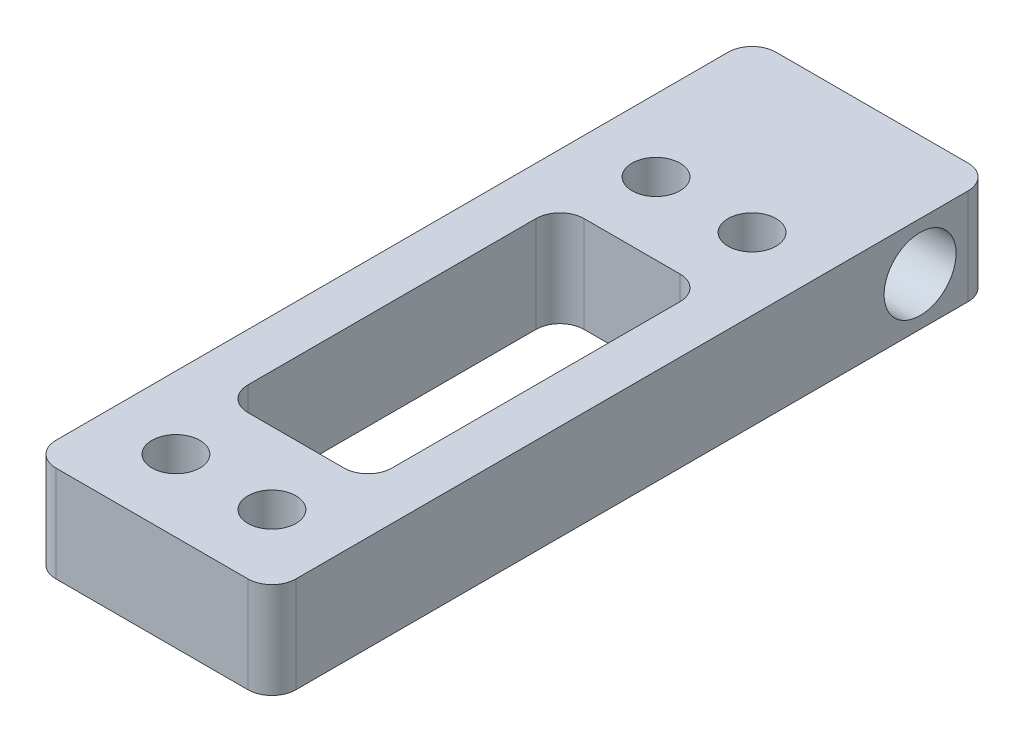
ISO-10303-21;
HEADER;
FILE_DESCRIPTION(('STEP AP214'),'2;1');
FILE_NAME('part.step','',(''),(''),'','','');
FILE_SCHEMA(('AUTOMOTIVE_DESIGN { 1 0 10303 214 1 1 1 1 }'));
ENDSEC;
DATA;
#1=APPLICATION_CONTEXT('core data for automotive mechanical design processes');
#2=APPLICATION_PROTOCOL_DEFINITION('international standard','automotive_design',2000,#1);
#3=PRODUCT_CONTEXT('',#1,'mechanical');
#4=PRODUCT('Part','Part','',(#3));
#5=PRODUCT_RELATED_PRODUCT_CATEGORY('part','',(#4));
#6=PRODUCT_DEFINITION_FORMATION('','',#4);
#7=PRODUCT_DEFINITION_CONTEXT('part definition',#1,'design');
#8=PRODUCT_DEFINITION('design','',#6,#7);
#9=PRODUCT_DEFINITION_SHAPE('','',#8);
#10=(LENGTH_UNIT() NAMED_UNIT(*) SI_UNIT(.MILLI.,.METRE.));
#11=(NAMED_UNIT(*) PLANE_ANGLE_UNIT() SI_UNIT($,.RADIAN.));
#12=(NAMED_UNIT(*) SI_UNIT($,.STERADIAN.) SOLID_ANGLE_UNIT());
#13=UNCERTAINTY_MEASURE_WITH_UNIT(LENGTH_MEASURE(1.E-05),#10,'distance_accuracy_value','');
#14=(GEOMETRIC_REPRESENTATION_CONTEXT(3) GLOBAL_UNCERTAINTY_ASSIGNED_CONTEXT((#13)) GLOBAL_UNIT_ASSIGNED_CONTEXT((#10,
#11,#12)) REPRESENTATION_CONTEXT('',''));
#15=CARTESIAN_POINT('',(0.,0.,0.));
#16=DIRECTION('',(0.,0.,1.));
#17=DIRECTION('',(1.,0.,0.));
#18=AXIS2_PLACEMENT_3D('',#15,#16,#17);
#19=CARTESIAN_POINT('',(31.75,0.,0.));
#20=DIRECTION('',(-1.,0.,0.));
#21=DIRECTION('',(0.,0.,1.));
#22=AXIS2_PLACEMENT_3D('',#19,#20,#21);
#23=PLANE('',#22);
#24=DIRECTION('',(0.,0.,1.));
#25=VECTOR('',#24,1.);
#26=CARTESIAN_POINT('',(31.75,6.35,85.725));
#27=LINE('',#26,#25);
#28=CARTESIAN_POINT('',(31.75,6.35,-6.34999999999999));
#29=VERTEX_POINT('',#28);
#30=CARTESIAN_POINT('',(31.75,6.35,82.55));
#31=VERTEX_POINT('',#30);
#32=EDGE_CURVE('E314',#29,#31,#27,.T.);
#33=ORIENTED_EDGE('',*,*,#32,.T.);
#34=DIRECTION('',(0.,-1.,0.));
#35=VECTOR('',#34,1.);
#36=CARTESIAN_POINT('',(31.75,0.,82.55));
#37=LINE('',#36,#35);
#38=CARTESIAN_POINT('',(31.75,-6.35,82.55));
#39=VERTEX_POINT('',#38);
#40=EDGE_CURVE('E200',#31,#39,#37,.T.);
#41=ORIENTED_EDGE('',*,*,#40,.T.);
#42=DIRECTION('',(0.,0.,-1.));
#43=VECTOR('',#42,1.);
#44=CARTESIAN_POINT('',(31.75,-6.35,85.725));
#45=LINE('',#44,#43);
#46=CARTESIAN_POINT('',(31.75,-6.35,-6.34999999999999));
#47=VERTEX_POINT('',#46);
#48=EDGE_CURVE('E156',#39,#47,#45,.T.);
#49=ORIENTED_EDGE('',*,*,#48,.T.);
#50=DIRECTION('',(0.,1.,0.));
#51=VECTOR('',#50,1.);
#52=CARTESIAN_POINT('',(31.75,0.,-6.35));
#53=LINE('',#52,#51);
#54=EDGE_CURVE('E197',#47,#29,#53,.T.);
#55=ORIENTED_EDGE('',*,*,#54,.T.);
#56=EDGE_LOOP('',(#33,#41,#49,#55));
#57=FACE_BOUND('',#56,.T.);
#58=CARTESIAN_POINT('',(31.75,0.,0.));
#59=DIRECTION('',(1.,0.,0.));
#60=DIRECTION('',(0.,0.,-1.));
#61=AXIS2_PLACEMENT_3D('',#58,#59,#60);
#62=CIRCLE('',#61,4.7625);
#63=CARTESIAN_POINT('',(31.75,0.,-4.7625));
#64=VERTEX_POINT('',#63);
#65=EDGE_CURVE('E308',#64,#64,#62,.T.);
#66=ORIENTED_EDGE('',*,*,#65,.F.);
#67=EDGE_LOOP('',(#66));
#68=FACE_BOUND('',#67,.T.);
#69=ADVANCED_FACE('F37',(#57,#68),#23,.F.);
#70=CARTESIAN_POINT('',(0.,0.,0.));
#71=DIRECTION('',(-1.,0.,0.));
#72=DIRECTION('',(0.,0.,1.));
#73=AXIS2_PLACEMENT_3D('',#70,#71,#72);
#74=PLANE('',#73);
#75=DIRECTION('',(0.,0.,-1.));
#76=VECTOR('',#75,1.);
#77=CARTESIAN_POINT('',(0.,-6.35,85.725));
#78=LINE('',#77,#76);
#79=CARTESIAN_POINT('',(0.,-6.35,82.55));
#80=VERTEX_POINT('',#79);
#81=CARTESIAN_POINT('',(0.,-6.35,-6.34999999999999));
#82=VERTEX_POINT('',#81);
#83=EDGE_CURVE('E317',#80,#82,#78,.T.);
#84=ORIENTED_EDGE('',*,*,#83,.F.);
#85=DIRECTION('',(0.,-1.,0.));
#86=VECTOR('',#85,1.);
#87=CARTESIAN_POINT('',(0.,6.35,82.55));
#88=LINE('',#87,#86);
#89=CARTESIAN_POINT('',(0.,6.35,82.55));
#90=VERTEX_POINT('',#89);
#91=EDGE_CURVE('E190',#80,#90,#88,.F.);
#92=ORIENTED_EDGE('',*,*,#91,.T.);
#93=DIRECTION('',(0.,0.,1.));
#94=VECTOR('',#93,1.);
#95=CARTESIAN_POINT('',(0.,6.35,85.725));
#96=LINE('',#95,#94);
#97=CARTESIAN_POINT('',(0.,6.35,-6.34999999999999));
#98=VERTEX_POINT('',#97);
#99=EDGE_CURVE('E311',#98,#90,#96,.T.);
#100=ORIENTED_EDGE('',*,*,#99,.F.);
#101=DIRECTION('',(0.,1.,0.));
#102=VECTOR('',#101,1.);
#103=CARTESIAN_POINT('',(0.,-6.35,-6.35));
#104=LINE('',#103,#102);
#105=EDGE_CURVE('E188',#98,#82,#104,.F.);
#106=ORIENTED_EDGE('',*,*,#105,.T.);
#107=EDGE_LOOP('',(#84,#92,#100,#106));
#108=FACE_BOUND('',#107,.T.);
#109=CARTESIAN_POINT('',(0.,0.,0.));
#110=DIRECTION('',(1.,0.,0.));
#111=DIRECTION('',(0.,0.,-1.));
#112=AXIS2_PLACEMENT_3D('',#109,#110,#111);
#113=CIRCLE('',#112,4.7625);
#114=CARTESIAN_POINT('',(0.,0.,-4.7625));
#115=VERTEX_POINT('',#114);
#116=EDGE_CURVE('E305',#115,#115,#113,.T.);
#117=ORIENTED_EDGE('',*,*,#116,.T.);
#118=EDGE_LOOP('',(#117));
#119=FACE_BOUND('',#118,.T.);
#120=ADVANCED_FACE('F331',(#108,#119),#74,.T.);
#121=CARTESIAN_POINT('',(31.75,-6.35,-9.525));
#122=DIRECTION('',(0.,0.,1.));
#123=DIRECTION('',(1.,0.,0.));
#124=AXIS2_PLACEMENT_3D('',#121,#122,#123);
#125=PLANE('',#124);
#126=DIRECTION('',(-1.,0.,0.));
#127=VECTOR('',#126,1.);
#128=CARTESIAN_POINT('',(31.75,-6.35,-9.525));
#129=LINE('',#128,#127);
#130=CARTESIAN_POINT('',(28.575,-6.35,-9.525));
#131=VERTEX_POINT('',#130);
#132=CARTESIAN_POINT('',(3.175,-6.35,-9.525));
#133=VERTEX_POINT('',#132);
#134=EDGE_CURVE('E173',#131,#133,#129,.T.);
#135=ORIENTED_EDGE('',*,*,#134,.T.);
#136=DIRECTION('',(0.,1.,0.));
#137=VECTOR('',#136,1.);
#138=CARTESIAN_POINT('',(3.175,6.35,-9.525));
#139=LINE('',#138,#137);
#140=CARTESIAN_POINT('',(3.175,6.35,-9.525));
#141=VERTEX_POINT('',#140);
#142=EDGE_CURVE('E204',#133,#141,#139,.T.);
#143=ORIENTED_EDGE('',*,*,#142,.T.);
#144=DIRECTION('',(-1.,0.,0.));
#145=VECTOR('',#144,1.);
#146=CARTESIAN_POINT('',(31.75,6.35,-9.525));
#147=LINE('',#146,#145);
#148=CARTESIAN_POINT('',(28.575,6.35,-9.525));
#149=VERTEX_POINT('',#148);
#150=EDGE_CURVE('E178',#149,#141,#147,.T.);
#151=ORIENTED_EDGE('',*,*,#150,.F.);
#152=DIRECTION('',(0.,1.,0.));
#153=VECTOR('',#152,1.);
#154=CARTESIAN_POINT('',(28.575,-6.35,-9.525));
#155=LINE('',#154,#153);
#156=EDGE_CURVE('E202',#149,#131,#155,.F.);
#157=ORIENTED_EDGE('',*,*,#156,.T.);
#158=EDGE_LOOP('',(#135,#143,#151,#157));
#159=FACE_BOUND('',#158,.T.);
#160=ADVANCED_FACE('F338',(#159),#125,.F.);
#161=CARTESIAN_POINT('',(31.75,6.35,85.725));
#162=DIRECTION('',(0.,-1.,0.));
#163=DIRECTION('',(0.,0.,-1.));
#164=AXIS2_PLACEMENT_3D('',#161,#162,#163);
#165=PLANE('',#164);
#166=DIRECTION('',(1.,0.,0.));
#167=VECTOR('',#166,1.);
#168=CARTESIAN_POINT('',(25.4,6.35,66.675));
#169=LINE('',#168,#167);
#170=CARTESIAN_POINT('',(9.525,6.35,66.675));
#171=VERTEX_POINT('',#170);
#172=CARTESIAN_POINT('',(22.225,6.35,66.675));
#173=VERTEX_POINT('',#172);
#174=EDGE_CURVE('E279',#171,#173,#169,.T.);
#175=ORIENTED_EDGE('',*,*,#174,.F.);
#176=CARTESIAN_POINT('',(9.525,6.35,63.5));
#177=DIRECTION('',(0.,-1.,0.));
#178=DIRECTION('',(0.,0.,-1.));
#179=AXIS2_PLACEMENT_3D('',#176,#177,#178);
#180=CIRCLE('',#179,3.175);
#181=CARTESIAN_POINT('',(6.35,6.35,63.5));
#182=VERTEX_POINT('',#181);
#183=EDGE_CURVE('E226',#171,#182,#180,.T.);
#184=ORIENTED_EDGE('',*,*,#183,.T.);
#185=DIRECTION('',(0.,0.,1.));
#186=VECTOR('',#185,1.);
#187=CARTESIAN_POINT('',(6.35,6.35,66.675));
#188=LINE('',#187,#186);
#189=CARTESIAN_POINT('',(6.35,6.35,25.4));
#190=VERTEX_POINT('',#189);
#191=EDGE_CURVE('E246',#190,#182,#188,.T.);
#192=ORIENTED_EDGE('',*,*,#191,.F.);
#193=CARTESIAN_POINT('',(9.525,6.35,25.4));
#194=DIRECTION('',(0.,-1.,0.));
#195=DIRECTION('',(0.,0.,-1.));
#196=AXIS2_PLACEMENT_3D('',#193,#194,#195);
#197=CIRCLE('',#196,3.175);
#198=CARTESIAN_POINT('',(9.52499999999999,6.35,22.225));
#199=VERTEX_POINT('',#198);
#200=EDGE_CURVE('E45',#190,#199,#197,.T.);
#201=ORIENTED_EDGE('',*,*,#200,.T.);
#202=DIRECTION('',(-1.,0.,0.));
#203=VECTOR('',#202,1.);
#204=CARTESIAN_POINT('',(25.4,6.35,22.225));
#205=LINE('',#204,#203);
#206=CARTESIAN_POINT('',(22.225,6.35,22.225));
#207=VERTEX_POINT('',#206);
#208=EDGE_CURVE('E244',#207,#199,#205,.T.);
#209=ORIENTED_EDGE('',*,*,#208,.F.);
#210=CARTESIAN_POINT('',(22.225,6.35,25.4));
#211=DIRECTION('',(0.,-1.,0.));
#212=DIRECTION('',(0.,0.,-1.));
#213=AXIS2_PLACEMENT_3D('',#210,#211,#212);
#214=CIRCLE('',#213,3.175);
#215=CARTESIAN_POINT('',(25.4,6.35,25.4));
#216=VERTEX_POINT('',#215);
#217=EDGE_CURVE('E234',#207,#216,#214,.T.);
#218=ORIENTED_EDGE('',*,*,#217,.T.);
#219=DIRECTION('',(0.,0.,-1.));
#220=VECTOR('',#219,1.);
#221=CARTESIAN_POINT('',(25.4,6.35,66.675));
#222=LINE('',#221,#220);
#223=CARTESIAN_POINT('',(25.4,6.35,63.5));
#224=VERTEX_POINT('',#223);
#225=EDGE_CURVE('E256',#224,#216,#222,.T.);
#226=ORIENTED_EDGE('',*,*,#225,.F.);
#227=CARTESIAN_POINT('',(22.225,6.35,63.5));
#228=DIRECTION('',(0.,-1.,0.));
#229=DIRECTION('',(0.,0.,-1.));
#230=AXIS2_PLACEMENT_3D('',#227,#228,#229);
#231=CIRCLE('',#230,3.175);
#232=EDGE_CURVE('E230',#224,#173,#231,.T.);
#233=ORIENTED_EDGE('',*,*,#232,.T.);
#234=EDGE_LOOP('',(#175,#184,#192,#201,#209,#218,#226,#233));
#235=FACE_BOUND('',#234,.T.);
#236=CARTESIAN_POINT('',(22.225,6.35,76.2));
#237=DIRECTION('',(0.,1.,0.));
#238=DIRECTION('',(0.,0.,1.));
#239=AXIS2_PLACEMENT_3D('',#236,#237,#238);
#240=CIRCLE('',#239,3.175);
#241=CARTESIAN_POINT('',(22.225,6.35,79.375));
#242=VERTEX_POINT('',#241);
#243=EDGE_CURVE('E277',#242,#242,#240,.T.);
#244=ORIENTED_EDGE('',*,*,#243,.F.);
#245=EDGE_LOOP('',(#244));
#246=FACE_BOUND('',#245,.T.);
#247=CARTESIAN_POINT('',(9.525,6.35,76.2));
#248=DIRECTION('',(0.,1.,0.));
#249=DIRECTION('',(0.,0.,1.));
#250=AXIS2_PLACEMENT_3D('',#247,#248,#249);
#251=CIRCLE('',#250,3.175);
#252=CARTESIAN_POINT('',(9.525,6.35,79.375));
#253=VERTEX_POINT('',#252);
#254=EDGE_CURVE('E287',#253,#253,#251,.T.);
#255=ORIENTED_EDGE('',*,*,#254,.F.);
#256=EDGE_LOOP('',(#255));
#257=FACE_BOUND('',#256,.T.);
#258=CARTESIAN_POINT('',(22.225,6.35,12.7));
#259=DIRECTION('',(0.,1.,0.));
#260=DIRECTION('',(0.,0.,1.));
#261=AXIS2_PLACEMENT_3D('',#258,#259,#260);
#262=CIRCLE('',#261,3.175);
#263=CARTESIAN_POINT('',(22.225,6.35,15.875));
#264=VERTEX_POINT('',#263);
#265=EDGE_CURVE('E293',#264,#264,#262,.T.);
#266=ORIENTED_EDGE('',*,*,#265,.F.);
#267=EDGE_LOOP('',(#266));
#268=FACE_BOUND('',#267,.T.);
#269=CARTESIAN_POINT('',(9.525,6.35,12.7));
#270=DIRECTION('',(0.,1.,0.));
#271=DIRECTION('',(0.,0.,1.));
#272=AXIS2_PLACEMENT_3D('',#269,#270,#271);
#273=CIRCLE('',#272,3.175);
#274=CARTESIAN_POINT('',(9.525,6.35,15.875));
#275=VERTEX_POINT('',#274);
#276=EDGE_CURVE('E299',#275,#275,#273,.T.);
#277=ORIENTED_EDGE('',*,*,#276,.F.);
#278=EDGE_LOOP('',(#277));
#279=FACE_BOUND('',#278,.T.);
#280=ORIENTED_EDGE('',*,*,#99,.T.);
#281=CARTESIAN_POINT('',(3.175,6.35,82.55));
#282=DIRECTION('',(0.,-1.,0.));
#283=DIRECTION('',(0.,0.,-1.));
#284=AXIS2_PLACEMENT_3D('',#281,#282,#283);
#285=CIRCLE('',#284,3.175);
#286=CARTESIAN_POINT('',(3.175,6.35,85.725));
#287=VERTEX_POINT('',#286);
#288=EDGE_CURVE('E195',#90,#287,#285,.F.);
#289=ORIENTED_EDGE('',*,*,#288,.T.);
#290=DIRECTION('',(-1.,0.,0.));
#291=VECTOR('',#290,1.);
#292=CARTESIAN_POINT('',(31.75,6.35,85.725));
#293=LINE('',#292,#291);
#294=CARTESIAN_POINT('',(28.575,6.35,85.725));
#295=VERTEX_POINT('',#294);
#296=EDGE_CURVE('E172',#295,#287,#293,.T.);
#297=ORIENTED_EDGE('',*,*,#296,.F.);
#298=CARTESIAN_POINT('',(28.575,6.35,82.55));
#299=DIRECTION('',(0.,-1.,0.));
#300=DIRECTION('',(0.,0.,-1.));
#301=AXIS2_PLACEMENT_3D('',#298,#299,#300);
#302=CIRCLE('',#301,3.175);
#303=EDGE_CURVE('E177',#295,#31,#302,.F.);
#304=ORIENTED_EDGE('',*,*,#303,.T.);
#305=ORIENTED_EDGE('',*,*,#32,.F.);
#306=CARTESIAN_POINT('',(28.575,6.35,-6.35));
#307=DIRECTION('',(0.,-1.,0.));
#308=DIRECTION('',(0.,0.,-1.));
#309=AXIS2_PLACEMENT_3D('',#306,#307,#308);
#310=CIRCLE('',#309,3.175);
#311=EDGE_CURVE('E60',#29,#149,#310,.F.);
#312=ORIENTED_EDGE('',*,*,#311,.T.);
#313=ORIENTED_EDGE('',*,*,#150,.T.);
#314=CARTESIAN_POINT('',(3.175,6.35,-6.35));
#315=DIRECTION('',(0.,-1.,0.));
#316=DIRECTION('',(0.,0.,-1.));
#317=AXIS2_PLACEMENT_3D('',#314,#315,#316);
#318=CIRCLE('',#317,3.175);
#319=EDGE_CURVE('E52',#141,#98,#318,.F.);
#320=ORIENTED_EDGE('',*,*,#319,.T.);
#321=EDGE_LOOP('',(#280,#289,#297,#304,#305,#312,#313,#320));
#322=FACE_BOUND('',#321,.T.);
#323=ADVANCED_FACE('F242',(#235,#246,#257,#268,#279,#322),#165,.F.);
#324=CARTESIAN_POINT('',(31.75,-6.35,85.725));
#325=DIRECTION('',(0.,0.,-1.));
#326=DIRECTION('',(-1.,0.,0.));
#327=AXIS2_PLACEMENT_3D('',#324,#325,#326);
#328=PLANE('',#327);
#329=ORIENTED_EDGE('',*,*,#296,.T.);
#330=DIRECTION('',(0.,-1.,0.));
#331=VECTOR('',#330,1.);
#332=CARTESIAN_POINT('',(3.175,-6.35,85.725));
#333=LINE('',#332,#331);
#334=CARTESIAN_POINT('',(3.175,-6.35,85.725));
#335=VERTEX_POINT('',#334);
#336=EDGE_CURVE('E171',#287,#335,#333,.T.);
#337=ORIENTED_EDGE('',*,*,#336,.T.);
#338=DIRECTION('',(-1.,0.,0.));
#339=VECTOR('',#338,1.);
#340=CARTESIAN_POINT('',(31.75,-6.35,85.725));
#341=LINE('',#340,#339);
#342=CARTESIAN_POINT('',(28.575,-6.35,85.725));
#343=VERTEX_POINT('',#342);
#344=EDGE_CURVE('E154',#343,#335,#341,.T.);
#345=ORIENTED_EDGE('',*,*,#344,.F.);
#346=DIRECTION('',(0.,-1.,0.));
#347=VECTOR('',#346,1.);
#348=CARTESIAN_POINT('',(28.575,-6.35,85.725));
#349=LINE('',#348,#347);
#350=EDGE_CURVE('E168',#343,#295,#349,.F.);
#351=ORIENTED_EDGE('',*,*,#350,.T.);
#352=EDGE_LOOP('',(#329,#337,#345,#351));
#353=FACE_BOUND('',#352,.T.);
#354=ADVANCED_FACE('F167',(#353),#328,.F.);
#355=CARTESIAN_POINT('',(31.75,-6.35,85.725));
#356=DIRECTION('',(0.,1.,0.));
#357=DIRECTION('',(0.,0.,1.));
#358=AXIS2_PLACEMENT_3D('',#355,#356,#357);
#359=PLANE('',#358);
#360=DIRECTION('',(0.,0.,-1.));
#361=VECTOR('',#360,1.);
#362=CARTESIAN_POINT('',(25.4,-6.35,66.675));
#363=LINE('',#362,#361);
#364=CARTESIAN_POINT('',(25.4,-6.35,63.5));
#365=VERTEX_POINT('',#364);
#366=CARTESIAN_POINT('',(25.4,-6.35,25.4));
#367=VERTEX_POINT('',#366);
#368=EDGE_CURVE('E272',#365,#367,#363,.T.);
#369=ORIENTED_EDGE('',*,*,#368,.T.);
#370=CARTESIAN_POINT('',(22.225,-6.35,25.4));
#371=DIRECTION('',(0.,1.,0.));
#372=DIRECTION('',(0.,0.,1.));
#373=AXIS2_PLACEMENT_3D('',#370,#371,#372);
#374=CIRCLE('',#373,3.175);
#375=CARTESIAN_POINT('',(22.225,-6.35,22.225));
#376=VERTEX_POINT('',#375);
#377=EDGE_CURVE('E236',#367,#376,#374,.T.);
#378=ORIENTED_EDGE('',*,*,#377,.T.);
#379=DIRECTION('',(-1.,0.,0.));
#380=VECTOR('',#379,1.);
#381=CARTESIAN_POINT('',(25.4,-6.35,22.225));
#382=LINE('',#381,#380);
#383=CARTESIAN_POINT('',(9.52499999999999,-6.35,22.225));
#384=VERTEX_POINT('',#383);
#385=EDGE_CURVE('E265',#376,#384,#382,.T.);
#386=ORIENTED_EDGE('',*,*,#385,.T.);
#387=CARTESIAN_POINT('',(9.525,-6.35,25.4));
#388=DIRECTION('',(0.,1.,0.));
#389=DIRECTION('',(0.,0.,1.));
#390=AXIS2_PLACEMENT_3D('',#387,#388,#389);
#391=CIRCLE('',#390,3.175);
#392=CARTESIAN_POINT('',(6.35,-6.35,25.4));
#393=VERTEX_POINT('',#392);
#394=EDGE_CURVE('E11',#384,#393,#391,.T.);
#395=ORIENTED_EDGE('',*,*,#394,.T.);
#396=DIRECTION('',(0.,0.,1.));
#397=VECTOR('',#396,1.);
#398=CARTESIAN_POINT('',(6.35,-6.35,66.675));
#399=LINE('',#398,#397);
#400=CARTESIAN_POINT('',(6.35,-6.35,63.5));
#401=VERTEX_POINT('',#400);
#402=EDGE_CURVE('E255',#393,#401,#399,.T.);
#403=ORIENTED_EDGE('',*,*,#402,.T.);
#404=CARTESIAN_POINT('',(9.525,-6.35,63.5));
#405=DIRECTION('',(0.,1.,0.));
#406=DIRECTION('',(0.,0.,1.));
#407=AXIS2_PLACEMENT_3D('',#404,#405,#406);
#408=CIRCLE('',#407,3.175);
#409=CARTESIAN_POINT('',(9.525,-6.35,66.675));
#410=VERTEX_POINT('',#409);
#411=EDGE_CURVE('E228',#401,#410,#408,.T.);
#412=ORIENTED_EDGE('',*,*,#411,.T.);
#413=DIRECTION('',(1.,0.,0.));
#414=VECTOR('',#413,1.);
#415=CARTESIAN_POINT('',(25.4,-6.35,66.675));
#416=LINE('',#415,#414);
#417=CARTESIAN_POINT('',(22.225,-6.35,66.675));
#418=VERTEX_POINT('',#417);
#419=EDGE_CURVE('E269',#410,#418,#416,.T.);
#420=ORIENTED_EDGE('',*,*,#419,.T.);
#421=CARTESIAN_POINT('',(22.225,-6.35,63.5));
#422=DIRECTION('',(0.,1.,0.));
#423=DIRECTION('',(0.,0.,1.));
#424=AXIS2_PLACEMENT_3D('',#421,#422,#423);
#425=CIRCLE('',#424,3.175);
#426=EDGE_CURVE('E232',#418,#365,#425,.T.);
#427=ORIENTED_EDGE('',*,*,#426,.T.);
#428=EDGE_LOOP('',(#369,#378,#386,#395,#403,#412,#420,#427));
#429=FACE_BOUND('',#428,.T.);
#430=CARTESIAN_POINT('',(22.225,-6.35,76.2));
#431=DIRECTION('',(0.,1.,0.));
#432=DIRECTION('',(0.,0.,1.));
#433=AXIS2_PLACEMENT_3D('',#430,#431,#432);
#434=CIRCLE('',#433,3.175);
#435=CARTESIAN_POINT('',(22.225,-6.35,79.375));
#436=VERTEX_POINT('',#435);
#437=EDGE_CURVE('E284',#436,#436,#434,.T.);
#438=ORIENTED_EDGE('',*,*,#437,.T.);
#439=EDGE_LOOP('',(#438));
#440=FACE_BOUND('',#439,.T.);
#441=CARTESIAN_POINT('',(9.525,-6.35,76.2));
#442=DIRECTION('',(0.,1.,0.));
#443=DIRECTION('',(0.,0.,1.));
#444=AXIS2_PLACEMENT_3D('',#441,#442,#443);
#445=CIRCLE('',#444,3.175);
#446=CARTESIAN_POINT('',(9.525,-6.35,79.375));
#447=VERTEX_POINT('',#446);
#448=EDGE_CURVE('E290',#447,#447,#445,.T.);
#449=ORIENTED_EDGE('',*,*,#448,.T.);
#450=EDGE_LOOP('',(#449));
#451=FACE_BOUND('',#450,.T.);
#452=CARTESIAN_POINT('',(22.225,-6.35,12.7));
#453=DIRECTION('',(0.,1.,0.));
#454=DIRECTION('',(0.,0.,1.));
#455=AXIS2_PLACEMENT_3D('',#452,#453,#454);
#456=CIRCLE('',#455,3.175);
#457=CARTESIAN_POINT('',(22.225,-6.35,15.875));
#458=VERTEX_POINT('',#457);
#459=EDGE_CURVE('E296',#458,#458,#456,.T.);
#460=ORIENTED_EDGE('',*,*,#459,.T.);
#461=EDGE_LOOP('',(#460));
#462=FACE_BOUND('',#461,.T.);
#463=CARTESIAN_POINT('',(9.525,-6.35,12.7));
#464=DIRECTION('',(0.,1.,0.));
#465=DIRECTION('',(0.,0.,1.));
#466=AXIS2_PLACEMENT_3D('',#463,#464,#465);
#467=CIRCLE('',#466,3.175);
#468=CARTESIAN_POINT('',(9.525,-6.35,15.875));
#469=VERTEX_POINT('',#468);
#470=EDGE_CURVE('E302',#469,#469,#467,.T.);
#471=ORIENTED_EDGE('',*,*,#470,.T.);
#472=EDGE_LOOP('',(#471));
#473=FACE_BOUND('',#472,.T.);
#474=ORIENTED_EDGE('',*,*,#344,.T.);
#475=CARTESIAN_POINT('',(3.175,-6.35,82.55));
#476=DIRECTION('',(0.,1.,0.));
#477=DIRECTION('',(0.,0.,1.));
#478=AXIS2_PLACEMENT_3D('',#475,#476,#477);
#479=CIRCLE('',#478,3.175);
#480=EDGE_CURVE('E161',#335,#80,#479,.F.);
#481=ORIENTED_EDGE('',*,*,#480,.T.);
#482=ORIENTED_EDGE('',*,*,#83,.T.);
#483=CARTESIAN_POINT('',(3.175,-6.35,-6.35));
#484=DIRECTION('',(0.,1.,0.));
#485=DIRECTION('',(0.,0.,1.));
#486=AXIS2_PLACEMENT_3D('',#483,#484,#485);
#487=CIRCLE('',#486,3.175);
#488=EDGE_CURVE('E162',#82,#133,#487,.F.);
#489=ORIENTED_EDGE('',*,*,#488,.T.);
#490=ORIENTED_EDGE('',*,*,#134,.F.);
#491=CARTESIAN_POINT('',(28.575,-6.35,-6.35));
#492=DIRECTION('',(0.,1.,0.));
#493=DIRECTION('',(0.,0.,1.));
#494=AXIS2_PLACEMENT_3D('',#491,#492,#493);
#495=CIRCLE('',#494,3.175);
#496=EDGE_CURVE('E180',#131,#47,#495,.F.);
#497=ORIENTED_EDGE('',*,*,#496,.T.);
#498=ORIENTED_EDGE('',*,*,#48,.F.);
#499=CARTESIAN_POINT('',(28.575,-6.35,82.55));
#500=DIRECTION('',(0.,1.,0.));
#501=DIRECTION('',(0.,0.,1.));
#502=AXIS2_PLACEMENT_3D('',#499,#500,#501);
#503=CIRCLE('',#502,3.175);
#504=EDGE_CURVE('E151',#39,#343,#503,.F.);
#505=ORIENTED_EDGE('',*,*,#504,.T.);
#506=EDGE_LOOP('',(#474,#481,#482,#489,#490,#497,#498,#505));
#507=FACE_BOUND('',#506,.T.);
#508=ADVANCED_FACE('F153',(#429,#440,#451,#462,#473,#507),#359,.F.);
#509=CARTESIAN_POINT('',(31.75,0.,0.));
#510=DIRECTION('',(-1.,0.,0.));
#511=DIRECTION('',(0.,0.,1.));
#512=AXIS2_PLACEMENT_3D('',#509,#510,#511);
#513=CYLINDRICAL_SURFACE('',#512,4.7625);
#514=ORIENTED_EDGE('',*,*,#65,.T.);
#515=EDGE_LOOP('',(#514));
#516=FACE_BOUND('',#515,.T.);
#517=ORIENTED_EDGE('',*,*,#116,.F.);
#518=EDGE_LOOP('',(#517));
#519=FACE_BOUND('',#518,.T.);
#520=ADVANCED_FACE('F360',(#516,#519),#513,.F.);
#521=CARTESIAN_POINT('',(9.525,-6.35,12.7));
#522=DIRECTION('',(0.,1.,0.));
#523=DIRECTION('',(0.,0.,1.));
#524=AXIS2_PLACEMENT_3D('',#521,#522,#523);
#525=CYLINDRICAL_SURFACE('',#524,3.175);
#526=ORIENTED_EDGE('',*,*,#470,.F.);
#527=EDGE_LOOP('',(#526));
#528=FACE_BOUND('',#527,.T.);
#529=ORIENTED_EDGE('',*,*,#276,.T.);
#530=EDGE_LOOP('',(#529));
#531=FACE_BOUND('',#530,.T.);
#532=ADVANCED_FACE('F367',(#528,#531),#525,.F.);
#533=CARTESIAN_POINT('',(22.225,-6.35,12.7));
#534=DIRECTION('',(0.,1.,0.));
#535=DIRECTION('',(0.,0.,1.));
#536=AXIS2_PLACEMENT_3D('',#533,#534,#535);
#537=CYLINDRICAL_SURFACE('',#536,3.175);
#538=ORIENTED_EDGE('',*,*,#459,.F.);
#539=EDGE_LOOP('',(#538));
#540=FACE_BOUND('',#539,.T.);
#541=ORIENTED_EDGE('',*,*,#265,.T.);
#542=EDGE_LOOP('',(#541));
#543=FACE_BOUND('',#542,.T.);
#544=ADVANCED_FACE('F372',(#540,#543),#537,.F.);
#545=CARTESIAN_POINT('',(9.525,-6.35,76.2));
#546=DIRECTION('',(0.,1.,0.));
#547=DIRECTION('',(0.,0.,1.));
#548=AXIS2_PLACEMENT_3D('',#545,#546,#547);
#549=CYLINDRICAL_SURFACE('',#548,3.175);
#550=ORIENTED_EDGE('',*,*,#448,.F.);
#551=EDGE_LOOP('',(#550));
#552=FACE_BOUND('',#551,.T.);
#553=ORIENTED_EDGE('',*,*,#254,.T.);
#554=EDGE_LOOP('',(#553));
#555=FACE_BOUND('',#554,.T.);
#556=ADVANCED_FACE('F380',(#552,#555),#549,.F.);
#557=CARTESIAN_POINT('',(22.225,-6.35,76.2));
#558=DIRECTION('',(0.,1.,0.));
#559=DIRECTION('',(0.,0.,1.));
#560=AXIS2_PLACEMENT_3D('',#557,#558,#559);
#561=CYLINDRICAL_SURFACE('',#560,3.175);
#562=ORIENTED_EDGE('',*,*,#437,.F.);
#563=EDGE_LOOP('',(#562));
#564=FACE_BOUND('',#563,.T.);
#565=ORIENTED_EDGE('',*,*,#243,.T.);
#566=EDGE_LOOP('',(#565));
#567=FACE_BOUND('',#566,.T.);
#568=ADVANCED_FACE('F388',(#564,#567),#561,.F.);
#569=CARTESIAN_POINT('',(6.35,-6.35,66.675));
#570=DIRECTION('',(-1.,0.,0.));
#571=DIRECTION('',(0.,0.,1.));
#572=AXIS2_PLACEMENT_3D('',#569,#570,#571);
#573=PLANE('',#572);
#574=ORIENTED_EDGE('',*,*,#191,.T.);
#575=DIRECTION('',(0.,1.,0.));
#576=VECTOR('',#575,1.);
#577=CARTESIAN_POINT('',(6.35,-6.35,63.5));
#578=LINE('',#577,#576);
#579=EDGE_CURVE('E214',#182,#401,#578,.F.);
#580=ORIENTED_EDGE('',*,*,#579,.T.);
#581=ORIENTED_EDGE('',*,*,#402,.F.);
#582=DIRECTION('',(0.,1.,0.));
#583=VECTOR('',#582,1.);
#584=CARTESIAN_POINT('',(6.35,6.35,25.4));
#585=LINE('',#584,#583);
#586=EDGE_CURVE('E211',#393,#190,#585,.T.);
#587=ORIENTED_EDGE('',*,*,#586,.T.);
#588=EDGE_LOOP('',(#574,#580,#581,#587));
#589=FACE_BOUND('',#588,.T.);
#590=ADVANCED_FACE('F267',(#589),#573,.F.);
#591=CARTESIAN_POINT('',(25.4,-6.35,22.225));
#592=DIRECTION('',(0.,0.,-1.));
#593=DIRECTION('',(-1.,0.,0.));
#594=AXIS2_PLACEMENT_3D('',#591,#592,#593);
#595=PLANE('',#594);
#596=ORIENTED_EDGE('',*,*,#385,.F.);
#597=DIRECTION('',(0.,1.,0.));
#598=VECTOR('',#597,1.);
#599=CARTESIAN_POINT('',(22.225,6.35,22.225));
#600=LINE('',#599,#598);
#601=EDGE_CURVE('E223',#376,#207,#600,.T.);
#602=ORIENTED_EDGE('',*,*,#601,.T.);
#603=ORIENTED_EDGE('',*,*,#208,.T.);
#604=DIRECTION('',(0.,1.,0.));
#605=VECTOR('',#604,1.);
#606=CARTESIAN_POINT('',(9.52499999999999,-6.35,22.225));
#607=LINE('',#606,#605);
#608=EDGE_CURVE('E221',#199,#384,#607,.F.);
#609=ORIENTED_EDGE('',*,*,#608,.T.);
#610=EDGE_LOOP('',(#596,#602,#603,#609));
#611=FACE_BOUND('',#610,.T.);
#612=ADVANCED_FACE('F252',(#611),#595,.F.);
#613=CARTESIAN_POINT('',(25.4,-6.35,66.675));
#614=DIRECTION('',(1.,0.,0.));
#615=DIRECTION('',(0.,0.,-1.));
#616=AXIS2_PLACEMENT_3D('',#613,#614,#615);
#617=PLANE('',#616);
#618=ORIENTED_EDGE('',*,*,#368,.F.);
#619=DIRECTION('',(0.,1.,0.));
#620=VECTOR('',#619,1.);
#621=CARTESIAN_POINT('',(25.4,6.35,63.5));
#622=LINE('',#621,#620);
#623=EDGE_CURVE('E218',#365,#224,#622,.T.);
#624=ORIENTED_EDGE('',*,*,#623,.T.);
#625=ORIENTED_EDGE('',*,*,#225,.T.);
#626=DIRECTION('',(0.,1.,0.));
#627=VECTOR('',#626,1.);
#628=CARTESIAN_POINT('',(25.4,-6.35,25.4));
#629=LINE('',#628,#627);
#630=EDGE_CURVE('E216',#216,#367,#629,.F.);
#631=ORIENTED_EDGE('',*,*,#630,.T.);
#632=EDGE_LOOP('',(#618,#624,#625,#631));
#633=FACE_BOUND('',#632,.T.);
#634=ADVANCED_FACE('F398',(#633),#617,.F.);
#635=CARTESIAN_POINT('',(25.4,-6.35,66.675));
#636=DIRECTION('',(0.,0.,1.));
#637=DIRECTION('',(1.,0.,0.));
#638=AXIS2_PLACEMENT_3D('',#635,#636,#637);
#639=PLANE('',#638);
#640=ORIENTED_EDGE('',*,*,#419,.F.);
#641=DIRECTION('',(0.,1.,0.));
#642=VECTOR('',#641,1.);
#643=CARTESIAN_POINT('',(9.525,6.35,66.675));
#644=LINE('',#643,#642);
#645=EDGE_CURVE('E208',#410,#171,#644,.T.);
#646=ORIENTED_EDGE('',*,*,#645,.T.);
#647=ORIENTED_EDGE('',*,*,#174,.T.);
#648=DIRECTION('',(0.,1.,0.));
#649=VECTOR('',#648,1.);
#650=CARTESIAN_POINT('',(22.225,-6.35,66.675));
#651=LINE('',#650,#649);
#652=EDGE_CURVE('E206',#173,#418,#651,.F.);
#653=ORIENTED_EDGE('',*,*,#652,.T.);
#654=EDGE_LOOP('',(#640,#646,#647,#653));
#655=FACE_BOUND('',#654,.T.);
#656=ADVANCED_FACE('F395',(#655),#639,.F.);
#657=CARTESIAN_POINT('',(3.175,-6.35,82.55));
#658=DIRECTION('',(0.,1.,0.));
#659=DIRECTION('',(0.,0.,1.));
#660=AXIS2_PLACEMENT_3D('',#657,#658,#659);
#661=CYLINDRICAL_SURFACE('',#660,3.175);
#662=ORIENTED_EDGE('',*,*,#288,.F.);
#663=ORIENTED_EDGE('',*,*,#91,.F.);
#664=ORIENTED_EDGE('',*,*,#480,.F.);
#665=ORIENTED_EDGE('',*,*,#336,.F.);
#666=EDGE_LOOP('',(#662,#663,#664,#665));
#667=FACE_BOUND('',#666,.T.);
#668=ADVANCED_FACE('F326',(#667),#661,.T.);
#669=CARTESIAN_POINT('',(28.575,0.,82.55));
#670=DIRECTION('',(0.,-1.,0.));
#671=DIRECTION('',(0.,0.,-1.));
#672=AXIS2_PLACEMENT_3D('',#669,#670,#671);
#673=CYLINDRICAL_SURFACE('',#672,3.175);
#674=ORIENTED_EDGE('',*,*,#303,.F.);
#675=ORIENTED_EDGE('',*,*,#350,.F.);
#676=ORIENTED_EDGE('',*,*,#504,.F.);
#677=ORIENTED_EDGE('',*,*,#40,.F.);
#678=EDGE_LOOP('',(#674,#675,#676,#677));
#679=FACE_BOUND('',#678,.T.);
#680=ADVANCED_FACE('F176',(#679),#673,.T.);
#681=CARTESIAN_POINT('',(3.175,-6.35,-6.35));
#682=DIRECTION('',(0.,-1.,0.));
#683=DIRECTION('',(0.,0.,-1.));
#684=AXIS2_PLACEMENT_3D('',#681,#682,#683);
#685=CYLINDRICAL_SURFACE('',#684,3.175);
#686=ORIENTED_EDGE('',*,*,#488,.F.);
#687=ORIENTED_EDGE('',*,*,#105,.F.);
#688=ORIENTED_EDGE('',*,*,#319,.F.);
#689=ORIENTED_EDGE('',*,*,#142,.F.);
#690=EDGE_LOOP('',(#686,#687,#688,#689));
#691=FACE_BOUND('',#690,.T.);
#692=ADVANCED_FACE('F334',(#691),#685,.T.);
#693=CARTESIAN_POINT('',(28.575,0.,-6.35));
#694=DIRECTION('',(0.,1.,0.));
#695=DIRECTION('',(0.,0.,1.));
#696=AXIS2_PLACEMENT_3D('',#693,#694,#695);
#697=CYLINDRICAL_SURFACE('',#696,3.175);
#698=ORIENTED_EDGE('',*,*,#496,.F.);
#699=ORIENTED_EDGE('',*,*,#156,.F.);
#700=ORIENTED_EDGE('',*,*,#311,.F.);
#701=ORIENTED_EDGE('',*,*,#54,.F.);
#702=EDGE_LOOP('',(#698,#699,#700,#701));
#703=FACE_BOUND('',#702,.T.);
#704=ADVANCED_FACE('F341',(#703),#697,.T.);
#705=CARTESIAN_POINT('',(9.525,-6.35,63.5));
#706=DIRECTION('',(0.,-1.,0.));
#707=DIRECTION('',(0.,0.,-1.));
#708=AXIS2_PLACEMENT_3D('',#705,#706,#707);
#709=CYLINDRICAL_SURFACE('',#708,3.175);
#710=ORIENTED_EDGE('',*,*,#411,.F.);
#711=ORIENTED_EDGE('',*,*,#579,.F.);
#712=ORIENTED_EDGE('',*,*,#183,.F.);
#713=ORIENTED_EDGE('',*,*,#645,.F.);
#714=EDGE_LOOP('',(#710,#711,#712,#713));
#715=FACE_BOUND('',#714,.T.);
#716=ADVANCED_FACE('F440',(#715),#709,.F.);
#717=CARTESIAN_POINT('',(22.225,-6.35,63.5));
#718=DIRECTION('',(0.,-1.,0.));
#719=DIRECTION('',(0.,0.,-1.));
#720=AXIS2_PLACEMENT_3D('',#717,#718,#719);
#721=CYLINDRICAL_SURFACE('',#720,3.175);
#722=ORIENTED_EDGE('',*,*,#426,.F.);
#723=ORIENTED_EDGE('',*,*,#652,.F.);
#724=ORIENTED_EDGE('',*,*,#232,.F.);
#725=ORIENTED_EDGE('',*,*,#623,.F.);
#726=EDGE_LOOP('',(#722,#723,#724,#725));
#727=FACE_BOUND('',#726,.T.);
#728=ADVANCED_FACE('F447',(#727),#721,.F.);
#729=CARTESIAN_POINT('',(22.225,-6.35,25.4));
#730=DIRECTION('',(0.,-1.,0.));
#731=DIRECTION('',(0.,0.,-1.));
#732=AXIS2_PLACEMENT_3D('',#729,#730,#731);
#733=CYLINDRICAL_SURFACE('',#732,3.175);
#734=ORIENTED_EDGE('',*,*,#377,.F.);
#735=ORIENTED_EDGE('',*,*,#630,.F.);
#736=ORIENTED_EDGE('',*,*,#217,.F.);
#737=ORIENTED_EDGE('',*,*,#601,.F.);
#738=EDGE_LOOP('',(#734,#735,#736,#737));
#739=FACE_BOUND('',#738,.T.);
#740=ADVANCED_FACE('F455',(#739),#733,.F.);
#741=CARTESIAN_POINT('',(9.525,-6.35,25.4));
#742=DIRECTION('',(0.,-1.,0.));
#743=DIRECTION('',(0.,0.,-1.));
#744=AXIS2_PLACEMENT_3D('',#741,#742,#743);
#745=CYLINDRICAL_SURFACE('',#744,3.175);
#746=ORIENTED_EDGE('',*,*,#394,.F.);
#747=ORIENTED_EDGE('',*,*,#608,.F.);
#748=ORIENTED_EDGE('',*,*,#200,.F.);
#749=ORIENTED_EDGE('',*,*,#586,.F.);
#750=EDGE_LOOP('',(#746,#747,#748,#749));
#751=FACE_BOUND('',#750,.T.);
#752=ADVANCED_FACE('F39',(#751),#745,.F.);
#753=CLOSED_SHELL('',(#69,#120,#160,#323,#354,#508,#520,#532,#544,#556,#568,#590,#612,#634,#656,
#668,#680,#692,#704,#716,#728,#740,#752));
#754=MANIFOLD_SOLID_BREP('B2',#753);
#755=ADVANCED_BREP_SHAPE_REPRESENTATION('',(#18,#754),#14);
#756=SHAPE_DEFINITION_REPRESENTATION(#9,#755);
ENDSEC;
END-ISO-10303-21;
